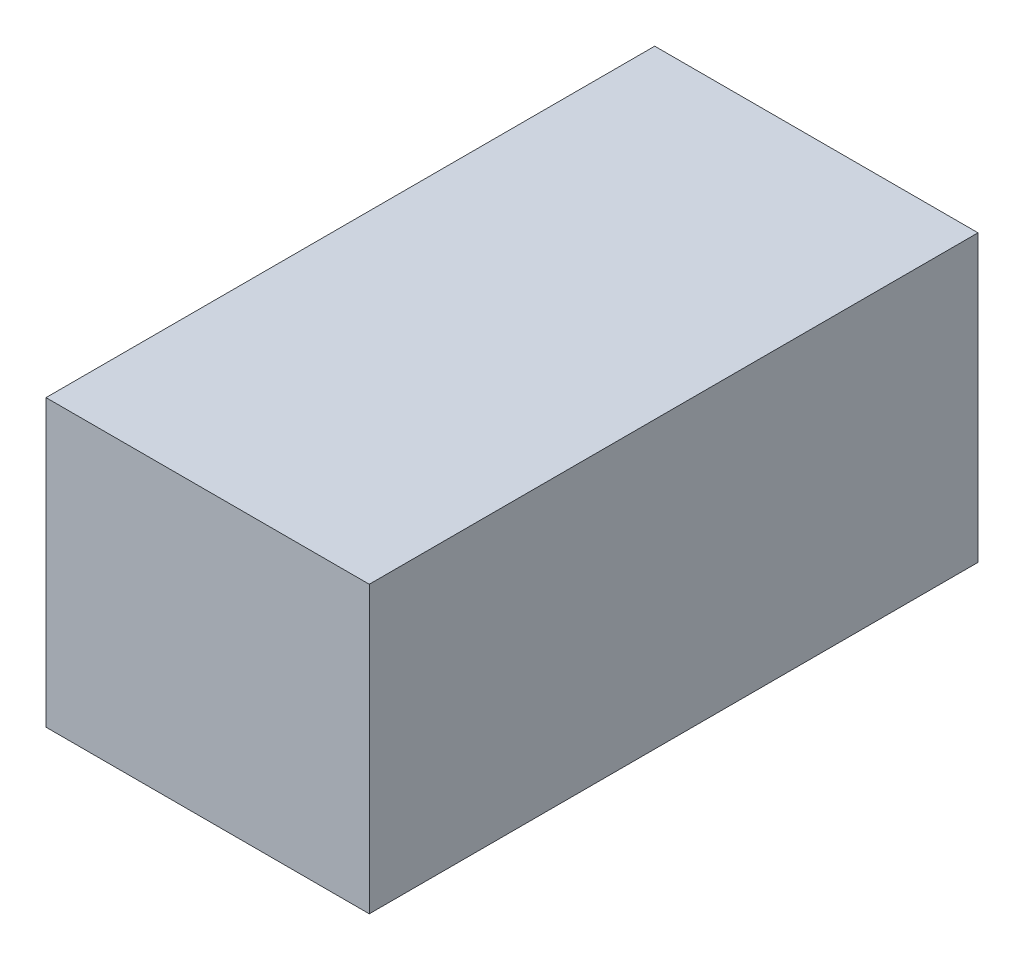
from build123d import *

# Parameters (mm, degrees)
SKETCH1_W           = 23.876
SKETCH1_H           = 21.082
BOSS_EXTRUDE1_DEPTH = 44.958


with BuildPart() as part:
    # Sketch1 → Boss-Extrude1 (new body)
    with BuildSketch(Plane.XY):
        Rectangle(SKETCH1_W, SKETCH1_H)
    extrude(amount=BOSS_EXTRUDE1_DEPTH)


solid = part.part
